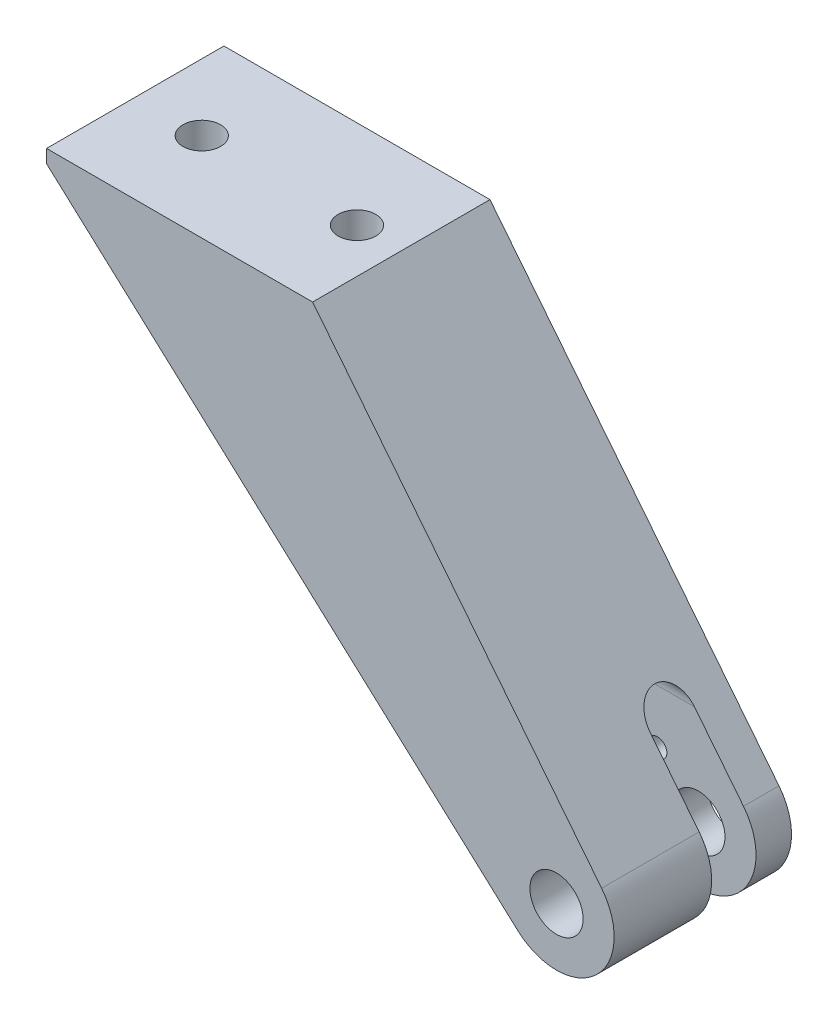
ISO-10303-21;
HEADER;
FILE_DESCRIPTION(('STEP AP214'),'2;1');
FILE_NAME('part.step','',(''),(''),'','','');
FILE_SCHEMA(('AUTOMOTIVE_DESIGN { 1 0 10303 214 1 1 1 1 }'));
ENDSEC;
DATA;
#1=APPLICATION_CONTEXT('core data for automotive mechanical design processes');
#2=APPLICATION_PROTOCOL_DEFINITION('international standard','automotive_design',2000,#1);
#3=PRODUCT_CONTEXT('',#1,'mechanical');
#4=PRODUCT('Part','Part','',(#3));
#5=PRODUCT_RELATED_PRODUCT_CATEGORY('part','',(#4));
#6=PRODUCT_DEFINITION_FORMATION('','',#4);
#7=PRODUCT_DEFINITION_CONTEXT('part definition',#1,'design');
#8=PRODUCT_DEFINITION('design','',#6,#7);
#9=PRODUCT_DEFINITION_SHAPE('','',#8);
#10=(LENGTH_UNIT() NAMED_UNIT(*) SI_UNIT(.MILLI.,.METRE.));
#11=(NAMED_UNIT(*) PLANE_ANGLE_UNIT() SI_UNIT($,.RADIAN.));
#12=(NAMED_UNIT(*) SI_UNIT($,.STERADIAN.) SOLID_ANGLE_UNIT());
#13=UNCERTAINTY_MEASURE_WITH_UNIT(LENGTH_MEASURE(1.E-05),#10,'distance_accuracy_value','');
#14=(GEOMETRIC_REPRESENTATION_CONTEXT(3) GLOBAL_UNCERTAINTY_ASSIGNED_CONTEXT((#13)) GLOBAL_UNIT_ASSIGNED_CONTEXT((#10,
#11,#12)) REPRESENTATION_CONTEXT('',''));
#15=CARTESIAN_POINT('',(0.,0.,0.));
#16=DIRECTION('',(0.,0.,1.));
#17=DIRECTION('',(1.,0.,0.));
#18=AXIS2_PLACEMENT_3D('',#15,#16,#17);
#19=CARTESIAN_POINT('',(-65.,90.,0.));
#20=DIRECTION('',(0.,-1.,0.));
#21=DIRECTION('',(0.,0.,-1.));
#22=AXIS2_PLACEMENT_3D('',#19,#20,#21);
#23=CYLINDRICAL_SURFACE('',#22,4.25000000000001);
#24=CARTESIAN_POINT('',(-65.,90.,0.));
#25=DIRECTION('',(0.,-1.,0.));
#26=DIRECTION('',(0.,0.,-1.));
#27=AXIS2_PLACEMENT_3D('',#24,#25,#26);
#28=CIRCLE('',#27,4.25000000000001);
#29=CARTESIAN_POINT('',(-65.,90.,-4.25000000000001));
#30=VERTEX_POINT('',#29);
#31=EDGE_CURVE('E148',#30,#30,#28,.F.);
#32=ORIENTED_EDGE('',*,*,#31,.T.);
#33=EDGE_LOOP('',(#32));
#34=FACE_BOUND('',#33,.T.);
#35=CARTESIAN_POINT('',(-65.,80.,0.));
#36=DIRECTION('',(0.,-1.,0.));
#37=DIRECTION('',(0.,0.,-1.));
#38=AXIS2_PLACEMENT_3D('',#35,#36,#37);
#39=CIRCLE('',#38,4.25000000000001);
#40=CARTESIAN_POINT('',(-65.,80.,-4.25000000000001));
#41=VERTEX_POINT('',#40);
#42=EDGE_CURVE('E19',#41,#41,#39,.T.);
#43=ORIENTED_EDGE('',*,*,#42,.T.);
#44=EDGE_LOOP('',(#43));
#45=FACE_BOUND('',#44,.T.);
#46=ADVANCED_FACE('F16',(#34,#45),#23,.F.);
#47=CARTESIAN_POINT('',(-100.,90.,0.));
#48=DIRECTION('',(0.,-1.,0.));
#49=DIRECTION('',(0.,0.,-1.));
#50=AXIS2_PLACEMENT_3D('',#47,#48,#49);
#51=CYLINDRICAL_SURFACE('',#50,4.25000000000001);
#52=CARTESIAN_POINT('',(-100.,90.,0.));
#53=DIRECTION('',(0.,-1.,0.));
#54=DIRECTION('',(0.,0.,-1.));
#55=AXIS2_PLACEMENT_3D('',#52,#53,#54);
#56=CIRCLE('',#55,4.25000000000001);
#57=CARTESIAN_POINT('',(-100.,90.,-4.25000000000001));
#58=VERTEX_POINT('',#57);
#59=EDGE_CURVE('E145',#58,#58,#56,.F.);
#60=ORIENTED_EDGE('',*,*,#59,.T.);
#61=EDGE_LOOP('',(#60));
#62=FACE_BOUND('',#61,.T.);
#63=CARTESIAN_POINT('',(-100.,80.,0.));
#64=DIRECTION('',(0.,-1.,0.));
#65=DIRECTION('',(0.,0.,-1.));
#66=AXIS2_PLACEMENT_3D('',#63,#64,#65);
#67=CIRCLE('',#66,4.25000000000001);
#68=CARTESIAN_POINT('',(-100.,80.,-4.25000000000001));
#69=VERTEX_POINT('',#68);
#70=EDGE_CURVE('E150',#69,#69,#67,.T.);
#71=ORIENTED_EDGE('',*,*,#70,.T.);
#72=EDGE_LOOP('',(#71));
#73=FACE_BOUND('',#72,.T.);
#74=ADVANCED_FACE('F161',(#62,#73),#51,.F.);
#75=CARTESIAN_POINT('',(-65.,80.,0.));
#76=DIRECTION('',(0.,1.,0.));
#77=DIRECTION('',(0.,0.,1.));
#78=AXIS2_PLACEMENT_3D('',#75,#76,#77);
#79=PLANE('',#78);
#80=CARTESIAN_POINT('',(-65.,80.,0.));
#81=DIRECTION('',(0.,1.,0.));
#82=DIRECTION('',(0.,0.,1.));
#83=AXIS2_PLACEMENT_3D('',#80,#81,#82);
#84=CIRCLE('',#83,7.);
#85=CARTESIAN_POINT('',(-65.,80.,7.));
#86=VERTEX_POINT('',#85);
#87=EDGE_CURVE('E140',#86,#86,#84,.F.);
#88=ORIENTED_EDGE('',*,*,#87,.T.);
#89=EDGE_LOOP('',(#88));
#90=FACE_BOUND('',#89,.T.);
#91=ORIENTED_EDGE('',*,*,#42,.F.);
#92=EDGE_LOOP('',(#91));
#93=FACE_BOUND('',#92,.T.);
#94=ADVANCED_FACE('F158',(#90,#93),#79,.F.);
#95=CARTESIAN_POINT('',(-100.,80.,0.));
#96=DIRECTION('',(0.,1.,0.));
#97=DIRECTION('',(0.,0.,1.));
#98=AXIS2_PLACEMENT_3D('',#95,#96,#97);
#99=PLANE('',#98);
#100=CARTESIAN_POINT('',(-100.,80.,0.));
#101=DIRECTION('',(0.,1.,0.));
#102=DIRECTION('',(0.,0.,1.));
#103=AXIS2_PLACEMENT_3D('',#100,#101,#102);
#104=CIRCLE('',#103,7.);
#105=CARTESIAN_POINT('',(-100.,80.,7.));
#106=VERTEX_POINT('',#105);
#107=EDGE_CURVE('E137',#106,#106,#104,.F.);
#108=ORIENTED_EDGE('',*,*,#107,.T.);
#109=EDGE_LOOP('',(#108));
#110=FACE_BOUND('',#109,.T.);
#111=ORIENTED_EDGE('',*,*,#70,.F.);
#112=EDGE_LOOP('',(#111));
#113=FACE_BOUND('',#112,.T.);
#114=ADVANCED_FACE('F160',(#110,#113),#99,.F.);
#115=CARTESIAN_POINT('',(-9.2069778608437,9.87327497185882,-20.));
#116=DIRECTION('',(0.,0.,-1.));
#117=DIRECTION('',(-1.,0.,0.));
#118=AXIS2_PLACEMENT_3D('',#115,#116,#117);
#119=CYLINDRICAL_SURFACE('',#118,2.1);
#120=CARTESIAN_POINT('',(-9.2069778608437,9.87327497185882,-12.));
#121=DIRECTION('',(0.,0.,-1.));
#122=DIRECTION('',(-1.,0.,0.));
#123=AXIS2_PLACEMENT_3D('',#120,#121,#122);
#124=CIRCLE('',#123,2.1);
#125=CARTESIAN_POINT('',(-11.3069778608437,9.87327497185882,-12.));
#126=VERTEX_POINT('',#125);
#127=EDGE_CURVE('E132',#126,#126,#124,.T.);
#128=ORIENTED_EDGE('',*,*,#127,.F.);
#129=EDGE_LOOP('',(#128));
#130=FACE_BOUND('',#129,.T.);
#131=CARTESIAN_POINT('',(-9.2069778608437,9.87327497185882,-20.));
#132=DIRECTION('',(0.,0.,-1.));
#133=DIRECTION('',(-1.,0.,0.));
#134=AXIS2_PLACEMENT_3D('',#131,#132,#133);
#135=CIRCLE('',#134,2.1);
#136=CARTESIAN_POINT('',(-11.3069778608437,9.87327497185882,-20.));
#137=VERTEX_POINT('',#136);
#138=EDGE_CURVE('E120',#137,#137,#135,.T.);
#139=ORIENTED_EDGE('',*,*,#138,.T.);
#140=EDGE_LOOP('',(#139));
#141=FACE_BOUND('',#140,.T.);
#142=ADVANCED_FACE('F169',(#130,#141),#119,.F.);
#143=CARTESIAN_POINT('',(0.,0.,20.));
#144=DIRECTION('',(0.,0.,-1.));
#145=DIRECTION('',(-1.,0.,0.));
#146=AXIS2_PLACEMENT_3D('',#143,#144,#145);
#147=CYLINDRICAL_SURFACE('',#146,6.);
#148=CARTESIAN_POINT('',(0.,0.,-20.));
#149=DIRECTION('',(0.,0.,-1.));
#150=DIRECTION('',(-1.,0.,0.));
#151=AXIS2_PLACEMENT_3D('',#148,#149,#150);
#152=CIRCLE('',#151,6.);
#153=CARTESIAN_POINT('',(-6.,0.,-20.));
#154=VERTEX_POINT('',#153);
#155=EDGE_CURVE('E112',#154,#154,#152,.T.);
#156=ORIENTED_EDGE('',*,*,#155,.T.);
#157=EDGE_LOOP('',(#156));
#158=FACE_BOUND('',#157,.T.);
#159=CARTESIAN_POINT('',(0.,0.,-12.));
#160=DIRECTION('',(0.,0.,-1.));
#161=DIRECTION('',(-1.,0.,0.));
#162=AXIS2_PLACEMENT_3D('',#159,#160,#161);
#163=CIRCLE('',#162,6.);
#164=CARTESIAN_POINT('',(-6.,0.,-12.));
#165=VERTEX_POINT('',#164);
#166=EDGE_CURVE('E128',#165,#165,#163,.T.);
#167=ORIENTED_EDGE('',*,*,#166,.F.);
#168=EDGE_LOOP('',(#167));
#169=FACE_BOUND('',#168,.T.);
#170=ADVANCED_FACE('F229',(#158,#169),#147,.F.);
#171=CARTESIAN_POINT('',(-115.,90.,20.));
#172=DIRECTION('',(0.,-1.,0.));
#173=DIRECTION('',(0.,0.,-1.));
#174=AXIS2_PLACEMENT_3D('',#171,#172,#173);
#175=PLANE('',#174);
#176=DIRECTION('',(0.,0.,-1.));
#177=VECTOR('',#176,1.);
#178=CARTESIAN_POINT('',(-115.,90.,20.));
#179=LINE('',#178,#177);
#180=CARTESIAN_POINT('',(-115.,90.,-20.));
#181=VERTEX_POINT('',#180);
#182=CARTESIAN_POINT('',(-115.,90.,20.));
#183=VERTEX_POINT('',#182);
#184=EDGE_CURVE('E115',#181,#183,#179,.F.);
#185=ORIENTED_EDGE('',*,*,#184,.T.);
#186=DIRECTION('',(1.,0.,0.));
#187=VECTOR('',#186,1.);
#188=CARTESIAN_POINT('',(0.,90.,20.));
#189=LINE('',#188,#187);
#190=CARTESIAN_POINT('',(-55.,90.,20.));
#191=VERTEX_POINT('',#190);
#192=EDGE_CURVE('E461',#191,#183,#189,.F.);
#193=ORIENTED_EDGE('',*,*,#192,.F.);
#194=DIRECTION('',(0.,0.,1.));
#195=VECTOR('',#194,1.);
#196=CARTESIAN_POINT('',(-55.,90.,20.));
#197=LINE('',#196,#195);
#198=CARTESIAN_POINT('',(-55.,90.,-20.));
#199=VERTEX_POINT('',#198);
#200=EDGE_CURVE('E144',#191,#199,#197,.F.);
#201=ORIENTED_EDGE('',*,*,#200,.T.);
#202=DIRECTION('',(1.,0.,0.));
#203=VECTOR('',#202,1.);
#204=CARTESIAN_POINT('',(0.,90.,-20.));
#205=LINE('',#204,#203);
#206=EDGE_CURVE('E119',#199,#181,#205,.F.);
#207=ORIENTED_EDGE('',*,*,#206,.T.);
#208=EDGE_LOOP('',(#185,#193,#201,#207));
#209=FACE_BOUND('',#208,.T.);
#210=ORIENTED_EDGE('',*,*,#59,.F.);
#211=EDGE_LOOP('',(#210));
#212=FACE_BOUND('',#211,.T.);
#213=ORIENTED_EDGE('',*,*,#31,.F.);
#214=EDGE_LOOP('',(#213));
#215=FACE_BOUND('',#214,.T.);
#216=ADVANCED_FACE('F225',(#209,#212,#215),#175,.F.);
#217=CARTESIAN_POINT('',(0.,0.,20.));
#218=DIRECTION('',(0.,0.,-1.));
#219=DIRECTION('',(-1.,0.,0.));
#220=AXIS2_PLACEMENT_3D('',#217,#218,#219);
#221=CYLINDRICAL_SURFACE('',#220,6.);
#222=CARTESIAN_POINT('',(0.,0.,-2.));
#223=DIRECTION('',(0.,0.,-1.));
#224=DIRECTION('',(-1.,0.,0.));
#225=AXIS2_PLACEMENT_3D('',#222,#223,#224);
#226=CIRCLE('',#225,6.);
#227=CARTESIAN_POINT('',(-6.,0.,-2.));
#228=VERTEX_POINT('',#227);
#229=EDGE_CURVE('E83',#228,#228,#226,.F.);
#230=ORIENTED_EDGE('',*,*,#229,.F.);
#231=EDGE_LOOP('',(#230));
#232=FACE_BOUND('',#231,.T.);
#233=CARTESIAN_POINT('',(0.,0.,20.));
#234=DIRECTION('',(0.,0.,-1.));
#235=DIRECTION('',(-1.,0.,0.));
#236=AXIS2_PLACEMENT_3D('',#233,#234,#235);
#237=CIRCLE('',#236,6.);
#238=CARTESIAN_POINT('',(-6.,0.,20.));
#239=VERTEX_POINT('',#238);
#240=EDGE_CURVE('E94',#239,#239,#237,.T.);
#241=ORIENTED_EDGE('',*,*,#240,.F.);
#242=EDGE_LOOP('',(#241));
#243=FACE_BOUND('',#242,.T.);
#244=ADVANCED_FACE('F222',(#232,#243),#221,.F.);
#245=CARTESIAN_POINT('',(-55.,90.,20.));
#246=DIRECTION('',(-0.782506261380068,-0.62264271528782,0.));
#247=DIRECTION('',(0.62264271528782,-0.782506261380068,0.));
#248=AXIS2_PLACEMENT_3D('',#245,#246,#247);
#249=PLANE('',#248);
#250=CARTESIAN_POINT('',(-0.892184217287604,22.,-7.));
#251=DIRECTION('',(-0.782506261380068,-0.62264271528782,0.));
#252=DIRECTION('',(-0.62264271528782,0.782506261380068,0.));
#253=AXIS2_PLACEMENT_3D('',#250,#251,#252);
#254=ELLIPSE('',#253,6.38972522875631,5.);
#255=CARTESIAN_POINT('',(-0.8921842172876,22.,-2.));
#256=VERTEX_POINT('',#255);
#257=CARTESIAN_POINT('',(-0.892184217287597,22.,-12.));
#258=VERTEX_POINT('',#257);
#259=EDGE_CURVE('E73',#256,#258,#254,.T.);
#260=ORIENTED_EDGE('',*,*,#259,.T.);
#261=DIRECTION('',(-0.622642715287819,0.782506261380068,0.));
#262=VECTOR('',#261,1.);
#263=CARTESIAN_POINT('',(10.1725813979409,8.09435529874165,-12.));
#264=LINE('',#263,#262);
#265=CARTESIAN_POINT('',(10.1725813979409,8.09435529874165,-12.));
#266=VERTEX_POINT('',#265);
#267=EDGE_CURVE('E131',#266,#258,#264,.T.);
#268=ORIENTED_EDGE('',*,*,#267,.F.);
#269=DIRECTION('',(0.,0.,-1.));
#270=VECTOR('',#269,1.);
#271=CARTESIAN_POINT('',(10.1725813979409,8.09435529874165,20.));
#272=LINE('',#271,#270);
#273=CARTESIAN_POINT('',(10.1725813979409,8.09435529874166,-20.));
#274=VERTEX_POINT('',#273);
#275=EDGE_CURVE('E124',#274,#266,#272,.F.);
#276=ORIENTED_EDGE('',*,*,#275,.F.);
#277=DIRECTION('',(-0.62264271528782,0.782506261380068,0.));
#278=VECTOR('',#277,1.);
#279=CARTESIAN_POINT('',(10.1725813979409,8.09435529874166,-20.));
#280=LINE('',#279,#278);
#281=EDGE_CURVE('E123',#274,#199,#280,.T.);
#282=ORIENTED_EDGE('',*,*,#281,.T.);
#283=ORIENTED_EDGE('',*,*,#200,.F.);
#284=DIRECTION('',(-0.62264271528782,0.782506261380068,0.));
#285=VECTOR('',#284,1.);
#286=CARTESIAN_POINT('',(10.1725813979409,8.09435529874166,20.));
#287=LINE('',#286,#285);
#288=CARTESIAN_POINT('',(10.1725813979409,8.09435529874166,20.));
#289=VERTEX_POINT('',#288);
#290=EDGE_CURVE('E90',#289,#191,#287,.T.);
#291=ORIENTED_EDGE('',*,*,#290,.F.);
#292=DIRECTION('',(0.,0.,-1.));
#293=VECTOR('',#292,1.);
#294=CARTESIAN_POINT('',(10.1725813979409,8.09435529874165,20.));
#295=LINE('',#294,#293);
#296=CARTESIAN_POINT('',(10.1725813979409,8.09435529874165,-2.));
#297=VERTEX_POINT('',#296);
#298=EDGE_CURVE('E86',#297,#289,#295,.F.);
#299=ORIENTED_EDGE('',*,*,#298,.F.);
#300=DIRECTION('',(0.622642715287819,-0.782506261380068,0.));
#301=VECTOR('',#300,1.);
#302=CARTESIAN_POINT('',(-0.89218421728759,22.,-2.));
#303=LINE('',#302,#301);
#304=EDGE_CURVE('E76',#256,#297,#303,.T.);
#305=ORIENTED_EDGE('',*,*,#304,.F.);
#306=EDGE_LOOP('',(#260,#268,#276,#282,#283,#291,#299,#305));
#307=FACE_BOUND('',#306,.T.);
#308=ADVANCED_FACE('F87',(#307),#249,.F.);
#309=CARTESIAN_POINT('',(13.,22.,-7.));
#310=DIRECTION('',(-1.,0.,0.));
#311=DIRECTION('',(0.,0.,1.));
#312=AXIS2_PLACEMENT_3D('',#309,#310,#311);
#313=CYLINDRICAL_SURFACE('',#312,5.);
#314=DIRECTION('',(1.,0.,0.));
#315=VECTOR('',#314,1.);
#316=CARTESIAN_POINT('',(13.,22.,-2.));
#317=LINE('',#316,#315);
#318=CARTESIAN_POINT('',(-20.,22.,-2.));
#319=VERTEX_POINT('',#318);
#320=EDGE_CURVE('E81',#319,#256,#317,.T.);
#321=ORIENTED_EDGE('',*,*,#320,.F.);
#322=CARTESIAN_POINT('',(-20.,22.,-7.));
#323=DIRECTION('',(-1.,0.,0.));
#324=DIRECTION('',(0.,0.,1.));
#325=AXIS2_PLACEMENT_3D('',#322,#323,#324);
#326=CIRCLE('',#325,5.);
#327=CARTESIAN_POINT('',(-20.,22.,-12.));
#328=VERTEX_POINT('',#327);
#329=EDGE_CURVE('E135',#328,#319,#326,.F.);
#330=ORIENTED_EDGE('',*,*,#329,.F.);
#331=DIRECTION('',(1.,0.,0.));
#332=VECTOR('',#331,1.);
#333=CARTESIAN_POINT('',(13.,22.,-12.));
#334=LINE('',#333,#332);
#335=EDGE_CURVE('E451',#258,#328,#334,.F.);
#336=ORIENTED_EDGE('',*,*,#335,.F.);
#337=ORIENTED_EDGE('',*,*,#259,.F.);
#338=EDGE_LOOP('',(#321,#330,#336,#337));
#339=FACE_BOUND('',#338,.T.);
#340=ADVANCED_FACE('F216',(#339),#313,.F.);
#341=CARTESIAN_POINT('',(-65.,-13.,0.));
#342=DIRECTION('',(0.,1.,0.));
#343=DIRECTION('',(0.,0.,1.));
#344=AXIS2_PLACEMENT_3D('',#341,#342,#343);
#345=CYLINDRICAL_SURFACE('',#344,7.);
#346=CARTESIAN_POINT('',(-65.,41.5343793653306,0.));
#347=DIRECTION('',(0.672762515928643,0.739858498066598,0.));
#348=DIRECTION('',(-0.739858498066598,0.672762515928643,0.));
#349=AXIS2_PLACEMENT_3D('',#346,#347,#348);
#350=ELLIPSE('',#349,9.46126863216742,7.);
#351=CARTESIAN_POINT('',(-72.,47.8995662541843,0.));
#352=VERTEX_POINT('',#351);
#353=EDGE_CURVE('E104',#352,#352,#350,.F.);
#354=ORIENTED_EDGE('',*,*,#353,.T.);
#355=EDGE_LOOP('',(#354));
#356=FACE_BOUND('',#355,.T.);
#357=ORIENTED_EDGE('',*,*,#87,.F.);
#358=EDGE_LOOP('',(#357));
#359=FACE_BOUND('',#358,.T.);
#360=ADVANCED_FACE('F212',(#356,#359),#345,.F.);
#361=CARTESIAN_POINT('',(-100.,-13.,0.));
#362=DIRECTION('',(0.,1.,0.));
#363=DIRECTION('',(0.,0.,1.));
#364=AXIS2_PLACEMENT_3D('',#361,#362,#363);
#365=CYLINDRICAL_SURFACE('',#364,7.);
#366=CARTESIAN_POINT('',(-100.,73.3603138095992,0.));
#367=DIRECTION('',(0.672762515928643,0.739858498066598,0.));
#368=DIRECTION('',(-0.739858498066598,0.672762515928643,0.));
#369=AXIS2_PLACEMENT_3D('',#366,#367,#368);
#370=ELLIPSE('',#369,9.46126863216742,7.);
#371=CARTESIAN_POINT('',(-107.,79.7255006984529,0.));
#372=VERTEX_POINT('',#371);
#373=EDGE_CURVE('E476',#372,#372,#370,.F.);
#374=ORIENTED_EDGE('',*,*,#373,.T.);
#375=EDGE_LOOP('',(#374));
#376=FACE_BOUND('',#375,.T.);
#377=ORIENTED_EDGE('',*,*,#107,.F.);
#378=EDGE_LOOP('',(#377));
#379=FACE_BOUND('',#378,.T.);
#380=ADVANCED_FACE('F208',(#376,#379),#365,.F.);
#381=CARTESIAN_POINT('',(-20.,22.,-7.));
#382=DIRECTION('',(1.,0.,0.));
#383=DIRECTION('',(0.,0.,-1.));
#384=AXIS2_PLACEMENT_3D('',#381,#382,#383);
#385=PLANE('',#384);
#386=ORIENTED_EDGE('',*,*,#329,.T.);
#387=DIRECTION('',(0.,1.,0.));
#388=VECTOR('',#387,1.);
#389=CARTESIAN_POINT('',(-20.,22.,-2.));
#390=LINE('',#389,#388);
#391=CARTESIAN_POINT('',(-20.,0.615320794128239,-2.));
#392=VERTEX_POINT('',#391);
#393=EDGE_CURVE('E99',#392,#319,#390,.T.);
#394=ORIENTED_EDGE('',*,*,#393,.F.);
#395=DIRECTION('',(0.,0.,1.));
#396=VECTOR('',#395,1.);
#397=CARTESIAN_POINT('',(-20.,0.61532079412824,20.));
#398=LINE('',#397,#396);
#399=CARTESIAN_POINT('',(-20.,0.615320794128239,-12.));
#400=VERTEX_POINT('',#399);
#401=EDGE_CURVE('E446',#392,#400,#398,.F.);
#402=ORIENTED_EDGE('',*,*,#401,.T.);
#403=DIRECTION('',(0.,-1.,0.));
#404=VECTOR('',#403,1.);
#405=CARTESIAN_POINT('',(-20.,22.,-12.));
#406=LINE('',#405,#404);
#407=EDGE_CURVE('E127',#328,#400,#406,.T.);
#408=ORIENTED_EDGE('',*,*,#407,.F.);
#409=EDGE_LOOP('',(#386,#394,#402,#408));
#410=FACE_BOUND('',#409,.T.);
#411=ADVANCED_FACE('F204',(#410),#385,.T.);
#412=CARTESIAN_POINT('',(13.,22.,-12.));
#413=DIRECTION('',(0.,0.,1.));
#414=DIRECTION('',(0.,-1.,0.));
#415=AXIS2_PLACEMENT_3D('',#412,#413,#414);
#416=PLANE('',#415);
#417=DIRECTION('',(-0.739858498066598,0.672762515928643,0.));
#418=VECTOR('',#417,1.);
#419=CARTESIAN_POINT('',(-8.74591270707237,-9.61816047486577,-12.));
#420=LINE('',#419,#418);
#421=CARTESIAN_POINT('',(-8.74591270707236,-9.61816047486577,-12.));
#422=VERTEX_POINT('',#421);
#423=EDGE_CURVE('E432',#400,#422,#420,.F.);
#424=ORIENTED_EDGE('',*,*,#423,.T.);
#425=CARTESIAN_POINT('',(0.,0.,-12.));
#426=DIRECTION('',(0.,0.,-1.));
#427=DIRECTION('',(-1.,0.,0.));
#428=AXIS2_PLACEMENT_3D('',#425,#426,#427);
#429=CIRCLE('',#428,13.);
#430=EDGE_CURVE('E125',#266,#422,#429,.T.);
#431=ORIENTED_EDGE('',*,*,#430,.F.);
#432=ORIENTED_EDGE('',*,*,#267,.T.);
#433=ORIENTED_EDGE('',*,*,#335,.T.);
#434=ORIENTED_EDGE('',*,*,#407,.T.);
#435=EDGE_LOOP('',(#424,#431,#432,#433,#434));
#436=FACE_BOUND('',#435,.T.);
#437=ORIENTED_EDGE('',*,*,#166,.T.);
#438=EDGE_LOOP('',(#437));
#439=FACE_BOUND('',#438,.T.);
#440=ORIENTED_EDGE('',*,*,#127,.T.);
#441=EDGE_LOOP('',(#440));
#442=FACE_BOUND('',#441,.T.);
#443=ADVANCED_FACE('F200',(#436,#439,#442),#416,.T.);
#444=CARTESIAN_POINT('',(0.,0.,20.));
#445=DIRECTION('',(0.,0.,-1.));
#446=DIRECTION('',(-1.,0.,0.));
#447=AXIS2_PLACEMENT_3D('',#444,#445,#446);
#448=CYLINDRICAL_SURFACE('',#447,13.);
#449=CARTESIAN_POINT('',(0.,0.,-20.));
#450=DIRECTION('',(0.,0.,-1.));
#451=DIRECTION('',(-1.,0.,0.));
#452=AXIS2_PLACEMENT_3D('',#449,#450,#451);
#453=CIRCLE('',#452,13.);
#454=CARTESIAN_POINT('',(-8.74591270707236,-9.61816047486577,-20.));
#455=VERTEX_POINT('',#454);
#456=EDGE_CURVE('E116',#455,#274,#453,.F.);
#457=ORIENTED_EDGE('',*,*,#456,.T.);
#458=ORIENTED_EDGE('',*,*,#275,.T.);
#459=ORIENTED_EDGE('',*,*,#430,.T.);
#460=DIRECTION('',(0.,0.,1.));
#461=VECTOR('',#460,1.);
#462=CARTESIAN_POINT('',(-8.74591270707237,-9.61816047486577,20.));
#463=LINE('',#462,#461);
#464=EDGE_CURVE('E427',#422,#455,#463,.F.);
#465=ORIENTED_EDGE('',*,*,#464,.T.);
#466=EDGE_LOOP('',(#457,#458,#459,#465));
#467=FACE_BOUND('',#466,.T.);
#468=ADVANCED_FACE('F196',(#467),#448,.T.);
#469=CARTESIAN_POINT('',(0.,0.,-20.));
#470=DIRECTION('',(0.,0.,1.));
#471=DIRECTION('',(1.,0.,0.));
#472=AXIS2_PLACEMENT_3D('',#469,#470,#471);
#473=PLANE('',#472);
#474=ORIENTED_EDGE('',*,*,#155,.F.);
#475=EDGE_LOOP('',(#474));
#476=FACE_BOUND('',#475,.T.);
#477=DIRECTION('',(-0.739858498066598,0.672762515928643,0.));
#478=VECTOR('',#477,1.);
#479=CARTESIAN_POINT('',(-8.74591270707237,-9.61816047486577,-20.));
#480=LINE('',#479,#478);
#481=CARTESIAN_POINT('',(-115.,87.,-20.));
#482=VERTEX_POINT('',#481);
#483=EDGE_CURVE('E417',#455,#482,#480,.T.);
#484=ORIENTED_EDGE('',*,*,#483,.T.);
#485=DIRECTION('',(0.,1.,0.));
#486=VECTOR('',#485,1.);
#487=CARTESIAN_POINT('',(-115.,87.,-20.));
#488=LINE('',#487,#486);
#489=EDGE_CURVE('E421',#482,#181,#488,.T.);
#490=ORIENTED_EDGE('',*,*,#489,.T.);
#491=ORIENTED_EDGE('',*,*,#206,.F.);
#492=ORIENTED_EDGE('',*,*,#281,.F.);
#493=ORIENTED_EDGE('',*,*,#456,.F.);
#494=EDGE_LOOP('',(#484,#490,#491,#492,#493));
#495=FACE_BOUND('',#494,.T.);
#496=ORIENTED_EDGE('',*,*,#138,.F.);
#497=EDGE_LOOP('',(#496));
#498=FACE_BOUND('',#497,.T.);
#499=ADVANCED_FACE('F192',(#476,#495,#498),#473,.F.);
#500=CARTESIAN_POINT('',(-115.,87.,20.));
#501=DIRECTION('',(1.,0.,0.));
#502=DIRECTION('',(0.,0.,-1.));
#503=AXIS2_PLACEMENT_3D('',#500,#501,#502);
#504=PLANE('',#503);
#505=DIRECTION('',(0.,0.,1.));
#506=VECTOR('',#505,1.);
#507=CARTESIAN_POINT('',(-115.,87.,20.));
#508=LINE('',#507,#506);
#509=CARTESIAN_POINT('',(-115.,87.,20.));
#510=VERTEX_POINT('',#509);
#511=EDGE_CURVE('E426',#482,#510,#508,.T.);
#512=ORIENTED_EDGE('',*,*,#511,.T.);
#513=DIRECTION('',(0.,1.,0.));
#514=VECTOR('',#513,1.);
#515=CARTESIAN_POINT('',(-115.,0.,20.));
#516=LINE('',#515,#514);
#517=EDGE_CURVE('E111',#183,#510,#516,.F.);
#518=ORIENTED_EDGE('',*,*,#517,.F.);
#519=ORIENTED_EDGE('',*,*,#184,.F.);
#520=ORIENTED_EDGE('',*,*,#489,.F.);
#521=EDGE_LOOP('',(#512,#518,#519,#520));
#522=FACE_BOUND('',#521,.T.);
#523=ADVANCED_FACE('F188',(#522),#504,.F.);
#524=CARTESIAN_POINT('',(0.,0.,20.));
#525=DIRECTION('',(0.,0.,1.));
#526=DIRECTION('',(1.,0.,0.));
#527=AXIS2_PLACEMENT_3D('',#524,#525,#526);
#528=PLANE('',#527);
#529=ORIENTED_EDGE('',*,*,#240,.T.);
#530=EDGE_LOOP('',(#529));
#531=FACE_BOUND('',#530,.T.);
#532=ORIENTED_EDGE('',*,*,#517,.T.);
#533=DIRECTION('',(-0.739858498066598,0.672762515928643,0.));
#534=VECTOR('',#533,1.);
#535=CARTESIAN_POINT('',(-8.74591270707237,-9.61816047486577,20.));
#536=LINE('',#535,#534);
#537=CARTESIAN_POINT('',(-8.74591270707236,-9.61816047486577,20.));
#538=VERTEX_POINT('',#537);
#539=EDGE_CURVE('E430',#510,#538,#536,.F.);
#540=ORIENTED_EDGE('',*,*,#539,.T.);
#541=CARTESIAN_POINT('',(0.,0.,20.));
#542=DIRECTION('',(0.,0.,-1.));
#543=DIRECTION('',(-1.,0.,0.));
#544=AXIS2_PLACEMENT_3D('',#541,#542,#543);
#545=CIRCLE('',#544,13.);
#546=EDGE_CURVE('E93',#289,#538,#545,.T.);
#547=ORIENTED_EDGE('',*,*,#546,.F.);
#548=ORIENTED_EDGE('',*,*,#290,.T.);
#549=ORIENTED_EDGE('',*,*,#192,.T.);
#550=EDGE_LOOP('',(#532,#540,#547,#548,#549));
#551=FACE_BOUND('',#550,.T.);
#552=ADVANCED_FACE('F185',(#531,#551),#528,.T.);
#553=CARTESIAN_POINT('',(0.,0.,20.));
#554=DIRECTION('',(0.,0.,-1.));
#555=DIRECTION('',(-1.,0.,0.));
#556=AXIS2_PLACEMENT_3D('',#553,#554,#555);
#557=CYLINDRICAL_SURFACE('',#556,13.);
#558=ORIENTED_EDGE('',*,*,#298,.T.);
#559=ORIENTED_EDGE('',*,*,#546,.T.);
#560=DIRECTION('',(0.,0.,1.));
#561=VECTOR('',#560,1.);
#562=CARTESIAN_POINT('',(-8.74591270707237,-9.61816047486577,20.));
#563=LINE('',#562,#561);
#564=CARTESIAN_POINT('',(-8.74591270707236,-9.61816047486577,-2.));
#565=VERTEX_POINT('',#564);
#566=EDGE_CURVE('E25',#538,#565,#563,.F.);
#567=ORIENTED_EDGE('',*,*,#566,.T.);
#568=CARTESIAN_POINT('',(0.,0.,-2.));
#569=DIRECTION('',(0.,0.,-1.));
#570=DIRECTION('',(-1.,0.,0.));
#571=AXIS2_PLACEMENT_3D('',#568,#569,#570);
#572=CIRCLE('',#571,13.);
#573=EDGE_CURVE('E33',#297,#565,#572,.T.);
#574=ORIENTED_EDGE('',*,*,#573,.F.);
#575=EDGE_LOOP('',(#558,#559,#567,#574));
#576=FACE_BOUND('',#575,.T.);
#577=ADVANCED_FACE('F97',(#576),#557,.T.);
#578=CARTESIAN_POINT('',(13.,22.,-2.));
#579=DIRECTION('',(0.,0.,-1.));
#580=DIRECTION('',(0.,1.,0.));
#581=AXIS2_PLACEMENT_3D('',#578,#579,#580);
#582=PLANE('',#581);
#583=ORIENTED_EDGE('',*,*,#393,.T.);
#584=ORIENTED_EDGE('',*,*,#320,.T.);
#585=ORIENTED_EDGE('',*,*,#304,.T.);
#586=ORIENTED_EDGE('',*,*,#573,.T.);
#587=DIRECTION('',(-0.739858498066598,0.672762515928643,0.));
#588=VECTOR('',#587,1.);
#589=CARTESIAN_POINT('',(-8.74591270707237,-9.61816047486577,-2.));
#590=LINE('',#589,#588);
#591=EDGE_CURVE('E11',#565,#392,#590,.T.);
#592=ORIENTED_EDGE('',*,*,#591,.T.);
#593=EDGE_LOOP('',(#583,#584,#585,#586,#592));
#594=FACE_BOUND('',#593,.T.);
#595=ORIENTED_EDGE('',*,*,#229,.T.);
#596=EDGE_LOOP('',(#595));
#597=FACE_BOUND('',#596,.T.);
#598=ADVANCED_FACE('F79',(#594,#597),#582,.T.);
#599=CARTESIAN_POINT('',(-8.74591270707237,-9.61816047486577,20.));
#600=DIRECTION('',(0.672762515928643,0.739858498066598,0.));
#601=DIRECTION('',(-0.739858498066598,0.672762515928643,0.));
#602=AXIS2_PLACEMENT_3D('',#599,#600,#601);
#603=PLANE('',#602);
#604=ORIENTED_EDGE('',*,*,#566,.F.);
#605=ORIENTED_EDGE('',*,*,#539,.F.);
#606=ORIENTED_EDGE('',*,*,#511,.F.);
#607=ORIENTED_EDGE('',*,*,#483,.F.);
#608=ORIENTED_EDGE('',*,*,#464,.F.);
#609=ORIENTED_EDGE('',*,*,#423,.F.);
#610=ORIENTED_EDGE('',*,*,#401,.F.);
#611=ORIENTED_EDGE('',*,*,#591,.F.);
#612=EDGE_LOOP('',(#604,#605,#606,#607,#608,#609,#610,#611));
#613=FACE_BOUND('',#612,.T.);
#614=ORIENTED_EDGE('',*,*,#373,.F.);
#615=EDGE_LOOP('',(#614));
#616=FACE_BOUND('',#615,.T.);
#617=ORIENTED_EDGE('',*,*,#353,.F.);
#618=EDGE_LOOP('',(#617));
#619=FACE_BOUND('',#618,.T.);
#620=ADVANCED_FACE('F173',(#613,#616,#619),#603,.F.);
#621=CLOSED_SHELL('',(#46,#74,#94,#114,#142,#170,#216,#244,#308,#340,#360,#380,#411,#443,#468,
#499,#523,#552,#577,#598,#620));
#622=MANIFOLD_SOLID_BREP('B1',#621);
#623=ADVANCED_BREP_SHAPE_REPRESENTATION('',(#18,#622),#14);
#624=SHAPE_DEFINITION_REPRESENTATION(#9,#623);
ENDSEC;
END-ISO-10303-21;
